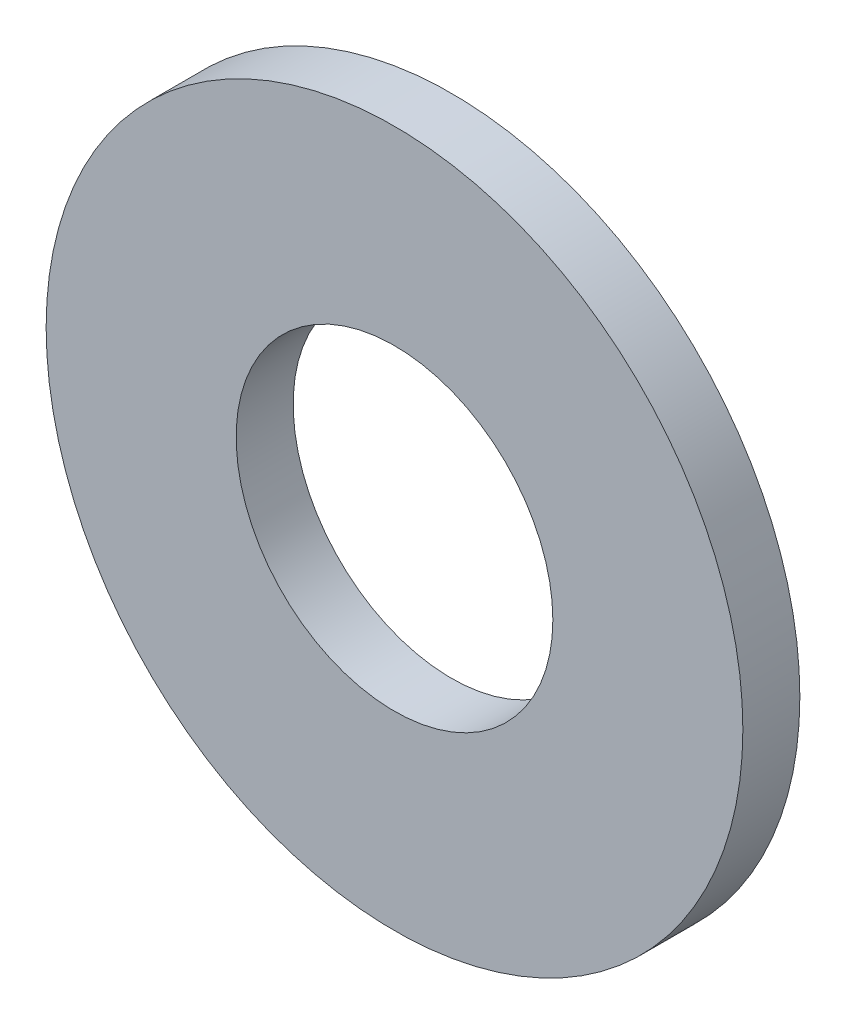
from build123d import *

# Parameters (mm, degrees)
ESQUISSE1_R        = 11
ESQUISSE1_R_2      = 5
BOSS_EXTRU_1_DEPTH = 1.8


with BuildPart() as part:
    # Esquisse1 → Boss.-Extru.1 (new body)
    with BuildSketch(Plane.XY):
        Circle(ESQUISSE1_R)
        Circle(ESQUISSE1_R_2, mode=Mode.SUBTRACT)
    extrude(amount=BOSS_EXTRU_1_DEPTH)


solid = part.part
